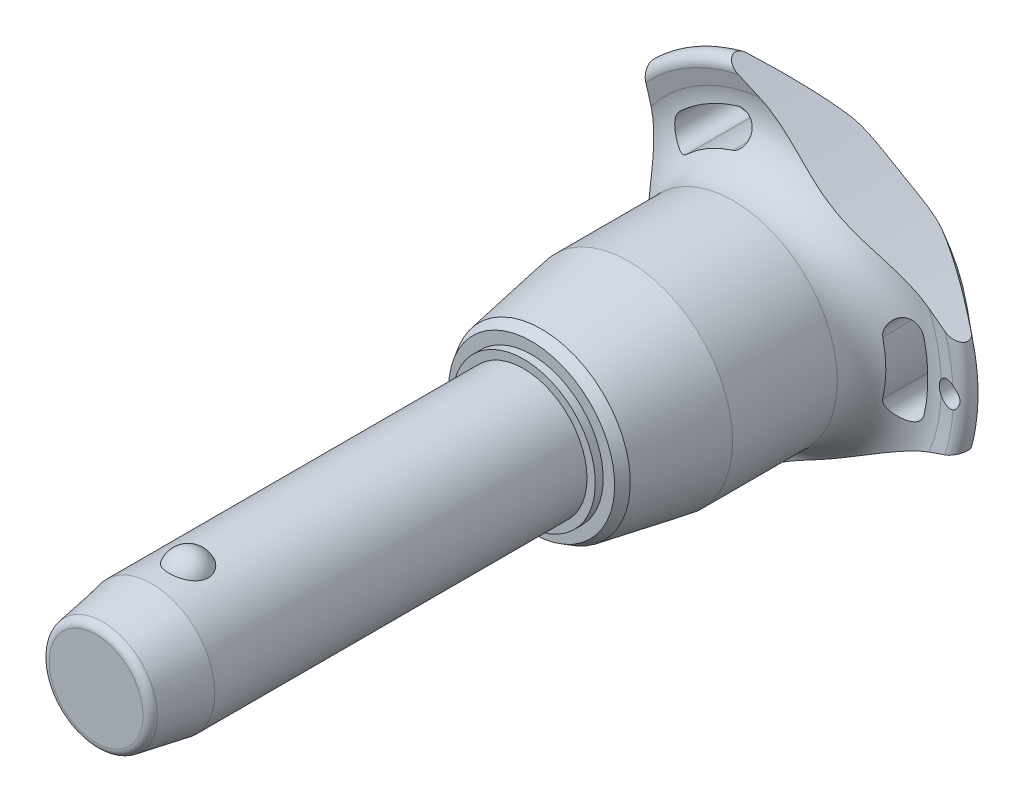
from build123d import *

# Parameters (mm, degrees)
SKETCH1_R           = 8
BOSS_EXTRUDE1_DEPTH = 40
SKETCH2_R           = 7
BOSS_EXTRUDE2_DEPTH = 39.7
BOSS_EXTRUDE3_START = 14
SKETCH1_2_R         = 8
BOSS_EXTRUDE3_DEPTH = 14
CHAMFER1_SIZE       = 7
CHAMFER1_SIZE2      = 1.234288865
FILLET1_R           = 1
SKETCH6_R           = 144.275
CUT_EXTRUDE1_DEPTH  = 87.518467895
CIRPATTERN1_COUNT   = 3
SKETCH7_R           = 1.5
CUT_EXTRUDE2_DEPTH  = 87.286194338


with BuildPart() as part:
    # Sketch1 → Boss-Extrude1 (new body)
    with BuildSketch(Plane.XY):
        Circle(SKETCH1_R)
    extrude(amount=-BOSS_EXTRUDE1_DEPTH)

    # Sketch2 → Boss-Extrude2 (add)
    with BuildSketch(Plane(origin=(0, 0, -40), x_dir=(-1, 0, 0), z_dir=(0, 0, -1))):
        Circle(SKETCH2_R)
    extrude(amount=BOSS_EXTRUDE2_DEPTH)

    # Sketch3 → Revolve1 (revolve)
    with BuildSketch(Plane(origin=(0, 0, 0), x_dir=(0, 0, -1), z_dir=(1, 0, 0))):
        with BuildLine():
            Line((-2.387467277, 9.5), (-2.387467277, 4.2))
            ThreePointArc((-2.387467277, 4.2), (0.262532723, 6.85), (-2.387467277, 9.5))
        make_face()
        with BuildLine():
            Line((-2.387467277, -4.2), (-2.387467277, -9.5))
            ThreePointArc((-2.387467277, -9.5), (0.262532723, -6.85), (-2.387467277, -4.2))
        make_face()
    revolve(axis=Axis((0, -4.2, 2.387467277), (0, 1, 0)))

    # Sketch1_2 → Boss-Extrude3 (add)
    with BuildSketch(Plane.XY.offset(BOSS_EXTRUDE3_START)):
        Circle(SKETCH1_2_R)
    extrude(amount=-BOSS_EXTRUDE3_DEPTH)

    # Chamfer1
    chamfer1_edges = [part.edges().sort_by_distance(p)[0] for p in [
        (-8, 0, 14),
    ]]
    chamfer1_side = [part.faces().sort_by_distance(p)[0] for p in [
        (-8, 0, -13),
    ]]
    chamfer(chamfer1_edges, length=CHAMFER1_SIZE, length2=CHAMFER1_SIZE2, reference=chamfer1_side[0])

    # Fillet1
    fillet1_edges = [part.edges().sort_by_distance(p)[0] for p in [
        (-6.765711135, 0, 14),
        (7, 0, -79.7),
    ]]
    fillet(fillet1_edges, radius=FILLET1_R)

    # Sketch4 → Revolve2 (revolve)
    with BuildSketch(Plane(origin=(0, 0, 0), x_dir=(0, 0, -1), z_dir=(1, 0, 0)), mode=Mode.PRIVATE) as revolve2_sk:
        Polygon((40, 0), (40, 9.044607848), (41, 9.044607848), (41, 10.490707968), (42.25235944, 11.213758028), (53.233333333, 13.15), (66.466666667, 13.15), (66.466666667, 0), align=None)
    revolve(revolve2_sk.sketch.rotate(Axis((0, 0, -66.466666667), (0, 0, 1)), 90), axis=Axis((0, 0, -66.466666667), (0, 0, 1)))

    # Sketch5 → Revolve3 (revolve)
    with BuildSketch(Plane(origin=(0, 0, 0), x_dir=(0, 0, -1), z_dir=(1, 0, 0)), mode=Mode.PRIVATE) as revolve3_sk:
        with BuildLine():
            Line((72.32877039, 20.428960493), (71.910912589, 22.344207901))
            ThreePointArc((71.910912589, 22.344207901), (72.554394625, 23.677136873), (74.002586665, 23.371345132))
            Line((74.002586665, 23.371345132), (79.141488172, 17.247040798))
            ThreePointArc((79.141488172, 17.247040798), (79.7, 15.584758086), (78.978803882, 13.986322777))
            ThreePointArc((78.978803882, 13.986322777), (74.617427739, 7.589034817), (73.083333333, 0))
            Line((73.083333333, 0), (66.466666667, 0))
            Line((66.466666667, 0), (66.466666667, 13.15))
            ThreePointArc((66.466666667, 13.15), (71.139661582, 15.38660811), (72.32877039, 20.428960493))
        make_face()
    revolve(revolve3_sk.sketch.rotate(Axis((0, 0, -73.083333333), (0, 0, 1)), 90), axis=Axis((0, 0, -73.083333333), (0, 0, 1)))

    # Sketch6 → Cut-Extrude1 (cut, through all)
    with BuildSketch(Plane.XY):
        with Locations((-159.975, 0)):
            Circle(SKETCH6_R)
        with BuildLine():
            ThreePointArc((18.131206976, -4.190753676), (18.60922037, 0), (18.131206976, 4.190753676))
            ThreePointArc((18.131206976, 4.190753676), (15.94840906, 5.553949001), (14.585213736, 3.371151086))
            ThreePointArc((14.585213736, 3.371151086), (14.969740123, 0), (14.585213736, -3.371151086))
            ThreePointArc((14.585213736, -3.371151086), (15.94840906, -5.553949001), (18.131206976, -4.190753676))
        make_face()
    cut_extrude1 = extrude(amount=-CUT_EXTRUDE1_DEPTH, mode=Mode.SUBTRACT)

    # CirPattern1: Cut-Extrude1 ×3 about axis
    cirpattern1_axis = Axis((0, 0, 0), (0, 0, 1))
    for i in range(1, CIRPATTERN1_COUNT):
        add(cut_extrude1.rotate(cirpattern1_axis, i * 360 / CIRPATTERN1_COUNT), mode=Mode.SUBTRACT)

    # Sketch7 → Cut-Extrude2 (cut, through all)
    with BuildSketch(Plane.XY):
        with Locations(Location((21.60922037, 0, 0), (0, 0, 297.620773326))):
            Circle(SKETCH7_R)
    extrude(amount=-CUT_EXTRUDE2_DEPTH, mode=Mode.SUBTRACT)


solid = part.part
